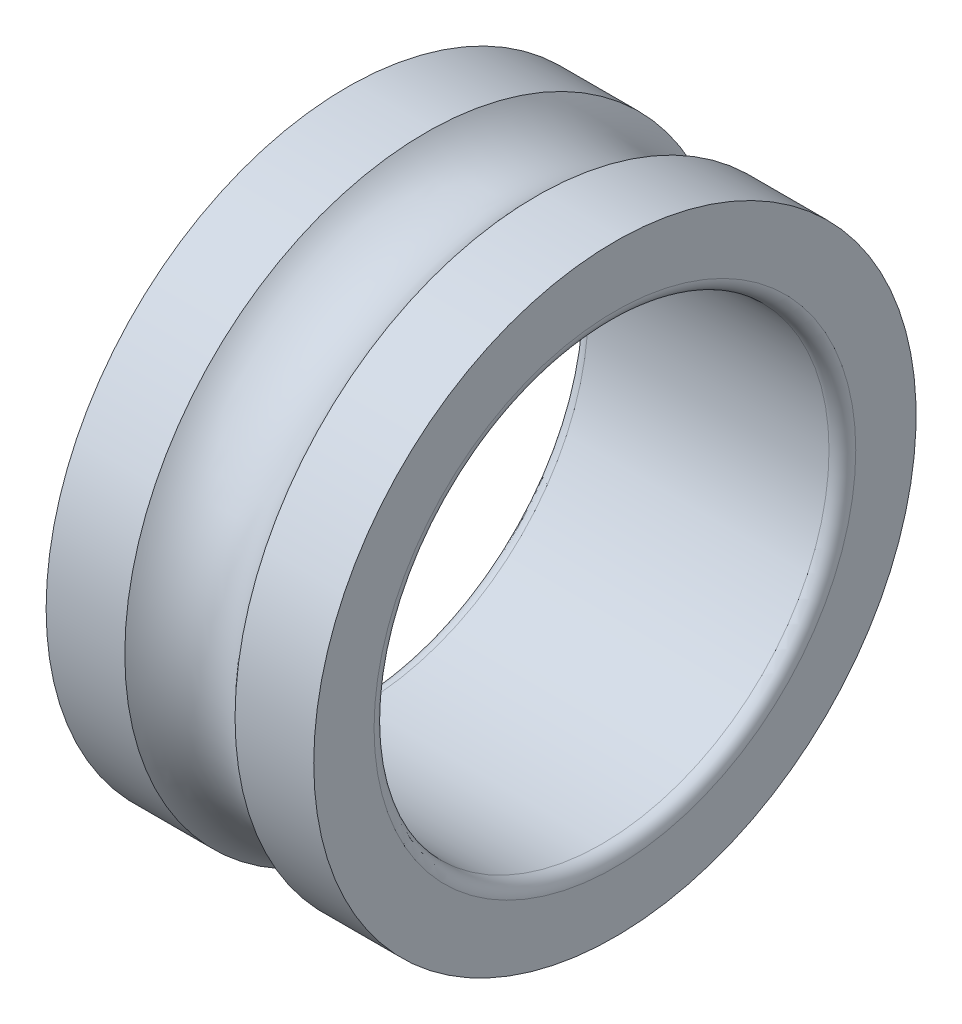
from build123d import *


with BuildPart() as part:
    # Esquisse1 → R_volution1 (revolve)
    with BuildSketch(Plane.XY, mode=Mode.PRIVATE) as r_volution1_sk:
        with BuildLine():
            Line((0, 11.254), (0, 9))
            ThreePointArc((0, 9), (0.146446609, 8.646446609), (0.5, 8.5))
            Line((0.5, 8.5), (9.5, 8.5))
            ThreePointArc((9.5, 8.5), (9.853553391, 8.646446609), (10, 9))
            Line((10, 9), (10, 11.254))
            Line((10, 11.254), (7.059486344, 11.254))
            ThreePointArc((7.059486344, 11.254), (5, 10.3), (2.940513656, 11.254))
            Line((2.940513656, 11.254), (0, 11.254))
        make_face()
    revolve(r_volution1_sk.sketch.rotate(Axis((10, 0, 0), (-1, 0, 0)), 270), axis=Axis((10, 0, 0), (-1, 0, 0)))


solid = part.part
